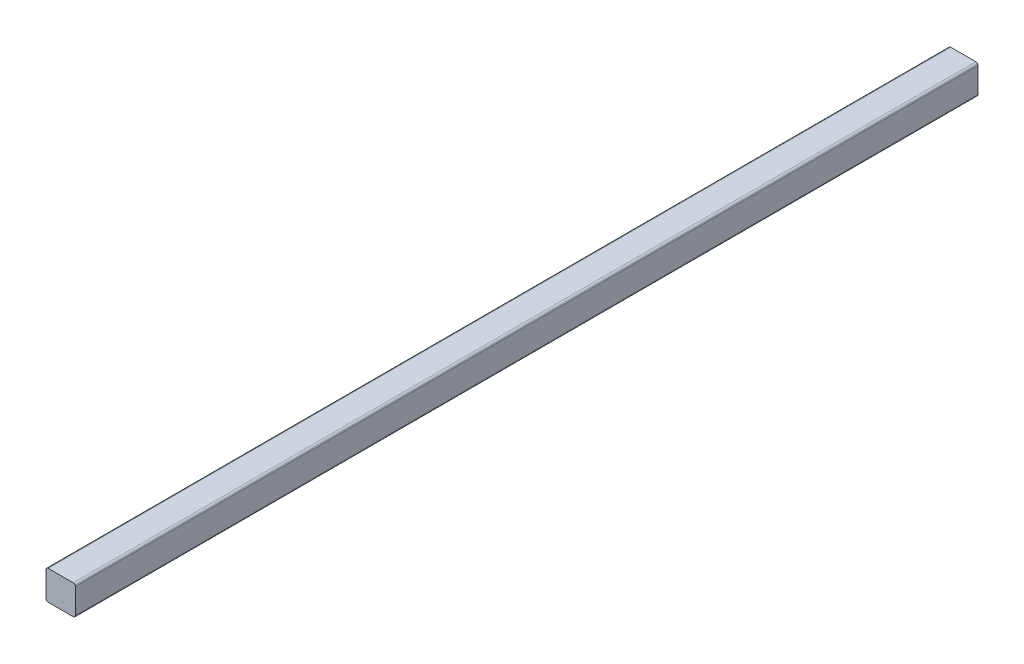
from build123d import *

# Parameters (mm, degrees)
EXTRUSION1_DEPTH = 920


with BuildPart() as part:
    # Esquisse1 → Extrusion1 (new body)
    with BuildSketch(Plane.XY):
        with BuildLine():
            Line((-15, 12.75), (-15, -12.75))
            ThreePointArc((-15, -12.75), (-14.340990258, -14.340990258), (-12.75, -15))
            Line((-12.75, -15), (12.75, -15))
            ThreePointArc((12.75, -15), (14.340990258, -14.340990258), (15, -12.75))
            Line((15, -12.75), (15, 12.75))
            ThreePointArc((15, 12.75), (14.340990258, 14.340990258), (12.75, 15))
            Line((12.75, 15), (-12.75, 15))
            ThreePointArc((-12.75, 15), (-14.340990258, 14.340990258), (-15, 12.75))
        make_face()
    extrude(amount=EXTRUSION1_DEPTH)


solid = part.part
